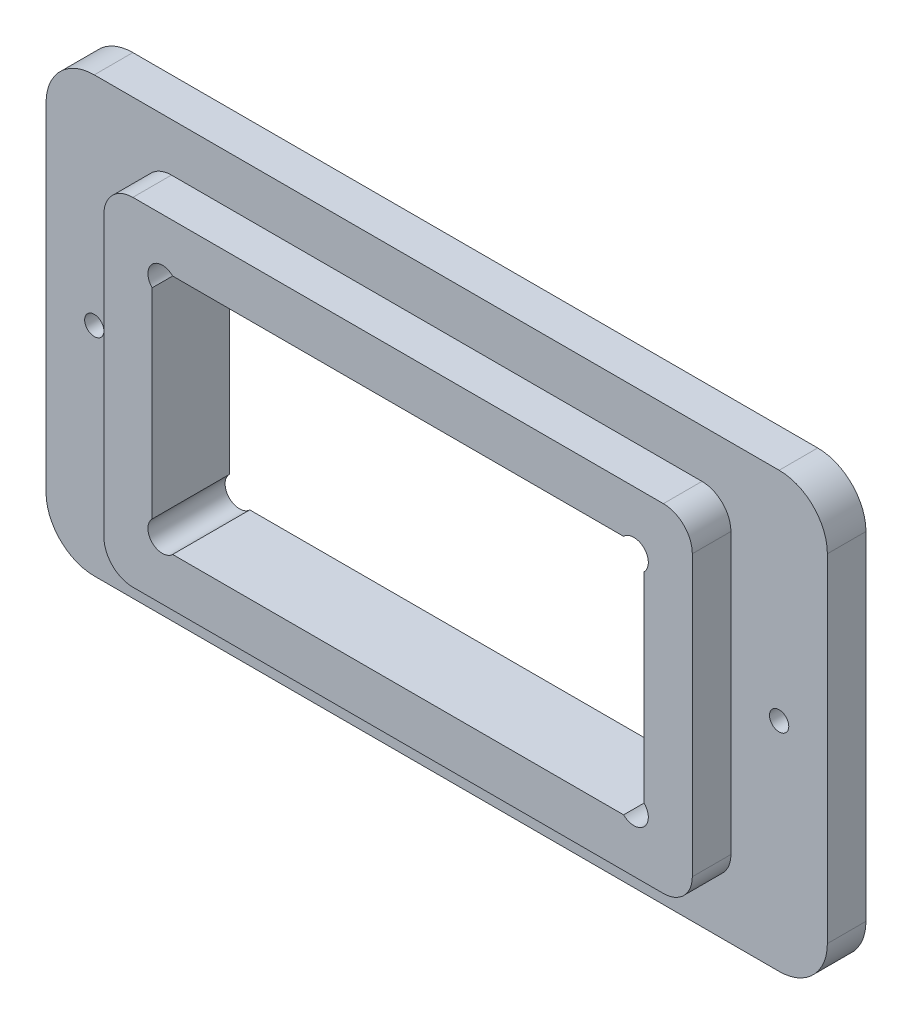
ISO-10303-21;
HEADER;
FILE_DESCRIPTION(('STEP AP214'),'2;1');
FILE_NAME('part.step','',(''),(''),'','','');
FILE_SCHEMA(('AUTOMOTIVE_DESIGN { 1 0 10303 214 1 1 1 1 }'));
ENDSEC;
DATA;
#1=APPLICATION_CONTEXT('core data for automotive mechanical design processes');
#2=APPLICATION_PROTOCOL_DEFINITION('international standard','automotive_design',2000,#1);
#3=PRODUCT_CONTEXT('',#1,'mechanical');
#4=PRODUCT('Part','Part','',(#3));
#5=PRODUCT_RELATED_PRODUCT_CATEGORY('part','',(#4));
#6=PRODUCT_DEFINITION_FORMATION('','',#4);
#7=PRODUCT_DEFINITION_CONTEXT('part definition',#1,'design');
#8=PRODUCT_DEFINITION('design','',#6,#7);
#9=PRODUCT_DEFINITION_SHAPE('','',#8);
#10=(LENGTH_UNIT() NAMED_UNIT(*) SI_UNIT(.MILLI.,.METRE.));
#11=(NAMED_UNIT(*) PLANE_ANGLE_UNIT() SI_UNIT($,.RADIAN.));
#12=(NAMED_UNIT(*) SI_UNIT($,.STERADIAN.) SOLID_ANGLE_UNIT());
#13=UNCERTAINTY_MEASURE_WITH_UNIT(LENGTH_MEASURE(1.E-05),#10,'distance_accuracy_value','');
#14=(GEOMETRIC_REPRESENTATION_CONTEXT(3) GLOBAL_UNCERTAINTY_ASSIGNED_CONTEXT((#13)) GLOBAL_UNIT_ASSIGNED_CONTEXT((#10,
#11,#12)) REPRESENTATION_CONTEXT('',''));
#15=CARTESIAN_POINT('',(0.,0.,0.));
#16=DIRECTION('',(0.,0.,1.));
#17=DIRECTION('',(1.,0.,0.));
#18=AXIS2_PLACEMENT_3D('',#15,#16,#17);
#19=CARTESIAN_POINT('',(-54.2516665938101,-16.1684939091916,8.));
#20=DIRECTION('',(0.,0.,1.));
#21=DIRECTION('',(1.,0.,0.));
#22=AXIS2_PLACEMENT_3D('',#19,#20,#21);
#23=PLANE('',#22);
#24=DIRECTION('',(0.,-1.,0.));
#25=VECTOR('',#24,1.);
#26=CARTESIAN_POINT('',(-44.2516665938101,11.7101857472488,8.));
#27=LINE('',#26,#25);
#28=CARTESIAN_POINT('',(-44.2516665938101,11.7101857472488,8.));
#29=VERTEX_POINT('',#28);
#30=CARTESIAN_POINT('',(-44.2516665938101,-9.04717356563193,8.));
#31=VERTEX_POINT('',#30);
#32=EDGE_CURVE('E309',#29,#31,#27,.T.);
#33=ORIENTED_EDGE('',*,*,#32,.F.);
#34=CARTESIAN_POINT('',(-43.1910064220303,12.7708459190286,8.));
#35=DIRECTION('',(0.,0.,1.));
#36=DIRECTION('',(1.,0.,0.));
#37=AXIS2_PLACEMENT_3D('',#34,#35,#36);
#38=CIRCLE('',#37,1.5);
#39=CARTESIAN_POINT('',(-42.1303462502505,13.8315060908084,8.));
#40=VERTEX_POINT('',#39);
#41=EDGE_CURVE('E307',#40,#29,#38,.T.);
#42=ORIENTED_EDGE('',*,*,#41,.F.);
#43=DIRECTION('',(-1.,0.,0.));
#44=VECTOR('',#43,1.);
#45=CARTESIAN_POINT('',(-42.1303462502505,13.8315060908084,8.));
#46=LINE('',#45,#44);
#47=CARTESIAN_POINT('',(4.62701306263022,13.8315060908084,8.));
#48=VERTEX_POINT('',#47);
#49=EDGE_CURVE('E323',#48,#40,#46,.T.);
#50=ORIENTED_EDGE('',*,*,#49,.F.);
#51=CARTESIAN_POINT('',(5.68767323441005,12.7708459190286,8.));
#52=DIRECTION('',(0.,0.,1.));
#53=DIRECTION('',(1.,0.,0.));
#54=AXIS2_PLACEMENT_3D('',#51,#52,#53);
#55=CIRCLE('',#54,1.50000000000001);
#56=CARTESIAN_POINT('',(6.74833340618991,11.7101857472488,8.));
#57=VERTEX_POINT('',#56);
#58=EDGE_CURVE('E320',#57,#48,#55,.T.);
#59=ORIENTED_EDGE('',*,*,#58,.F.);
#60=DIRECTION('',(0.,1.,0.));
#61=VECTOR('',#60,1.);
#62=CARTESIAN_POINT('',(6.74833340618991,11.7101857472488,8.));
#63=LINE('',#62,#61);
#64=CARTESIAN_POINT('',(6.74833340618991,-9.04717356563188,8.));
#65=VERTEX_POINT('',#64);
#66=EDGE_CURVE('E318',#65,#57,#63,.T.);
#67=ORIENTED_EDGE('',*,*,#66,.F.);
#68=CARTESIAN_POINT('',(5.68767323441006,-10.1078337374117,8.));
#69=DIRECTION('',(0.,0.,1.));
#70=DIRECTION('',(1.,0.,0.));
#71=AXIS2_PLACEMENT_3D('',#68,#69,#70);
#72=CIRCLE('',#71,1.50000000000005);
#73=CARTESIAN_POINT('',(4.62701306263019,-11.1684939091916,8.));
#74=VERTEX_POINT('',#73);
#75=EDGE_CURVE('E316',#74,#65,#72,.T.);
#76=ORIENTED_EDGE('',*,*,#75,.F.);
#77=DIRECTION('',(1.,0.,0.));
#78=VECTOR('',#77,1.);
#79=CARTESIAN_POINT('',(-42.1303462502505,-11.1684939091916,8.));
#80=LINE('',#79,#78);
#81=CARTESIAN_POINT('',(-42.1303462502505,-11.1684939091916,8.));
#82=VERTEX_POINT('',#81);
#83=EDGE_CURVE('E314',#82,#74,#80,.T.);
#84=ORIENTED_EDGE('',*,*,#83,.F.);
#85=CARTESIAN_POINT('',(-43.1910064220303,-10.1078337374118,8.));
#86=DIRECTION('',(0.,0.,1.));
#87=DIRECTION('',(1.,0.,0.));
#88=AXIS2_PLACEMENT_3D('',#85,#86,#87);
#89=CIRCLE('',#88,1.49999999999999);
#90=EDGE_CURVE('E312',#31,#82,#89,.T.);
#91=ORIENTED_EDGE('',*,*,#90,.F.);
#92=EDGE_LOOP('',(#33,#42,#50,#59,#67,#76,#84,#91));
#93=FACE_BOUND('',#92,.T.);
#94=DIRECTION('',(-1.,0.,0.));
#95=VECTOR('',#94,1.);
#96=CARTESIAN_POINT('',(-49.2516665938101,18.8315060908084,8.));
#97=LINE('',#96,#95);
#98=CARTESIAN_POINT('',(8.74833340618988,18.8315060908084,8.));
#99=VERTEX_POINT('',#98);
#100=CARTESIAN_POINT('',(-46.2516665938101,18.8315060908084,8.));
#101=VERTEX_POINT('',#100);
#102=EDGE_CURVE('E289',#99,#101,#97,.T.);
#103=ORIENTED_EDGE('',*,*,#102,.T.);
#104=CARTESIAN_POINT('',(-46.2516665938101,15.8315060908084,8.));
#105=DIRECTION('',(0.,0.,1.));
#106=DIRECTION('',(1.,0.,0.));
#107=AXIS2_PLACEMENT_3D('',#104,#105,#106);
#108=CIRCLE('',#107,3.);
#109=CARTESIAN_POINT('',(-49.2516665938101,15.8315060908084,8.));
#110=VERTEX_POINT('',#109);
#111=EDGE_CURVE('E247',#101,#110,#108,.T.);
#112=ORIENTED_EDGE('',*,*,#111,.T.);
#113=DIRECTION('',(0.,-1.,0.));
#114=VECTOR('',#113,1.);
#115=CARTESIAN_POINT('',(-49.2516665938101,18.8315060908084,8.));
#116=LINE('',#115,#114);
#117=CARTESIAN_POINT('',(-49.2516665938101,-13.1684939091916,8.));
#118=VERTEX_POINT('',#117);
#119=EDGE_CURVE('E292',#110,#118,#116,.T.);
#120=ORIENTED_EDGE('',*,*,#119,.T.);
#121=CARTESIAN_POINT('',(-46.2516665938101,-13.1684939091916,8.));
#122=DIRECTION('',(0.,0.,1.));
#123=DIRECTION('',(1.,0.,0.));
#124=AXIS2_PLACEMENT_3D('',#121,#122,#123);
#125=CIRCLE('',#124,3.);
#126=CARTESIAN_POINT('',(-46.2516665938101,-16.1684939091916,8.));
#127=VERTEX_POINT('',#126);
#128=EDGE_CURVE('E245',#118,#127,#125,.T.);
#129=ORIENTED_EDGE('',*,*,#128,.T.);
#130=DIRECTION('',(1.,0.,0.));
#131=VECTOR('',#130,1.);
#132=CARTESIAN_POINT('',(-49.2516665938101,-16.1684939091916,8.));
#133=LINE('',#132,#131);
#134=CARTESIAN_POINT('',(8.74833340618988,-16.1684939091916,8.));
#135=VERTEX_POINT('',#134);
#136=EDGE_CURVE('E286',#127,#135,#133,.T.);
#137=ORIENTED_EDGE('',*,*,#136,.T.);
#138=CARTESIAN_POINT('',(8.74833340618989,-13.1684939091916,8.));
#139=DIRECTION('',(0.,0.,1.));
#140=DIRECTION('',(1.,0.,0.));
#141=AXIS2_PLACEMENT_3D('',#138,#139,#140);
#142=CIRCLE('',#141,3.);
#143=CARTESIAN_POINT('',(11.7483334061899,-13.1684939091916,8.));
#144=VERTEX_POINT('',#143);
#145=EDGE_CURVE('E243',#135,#144,#142,.T.);
#146=ORIENTED_EDGE('',*,*,#145,.T.);
#147=DIRECTION('',(0.,1.,0.));
#148=VECTOR('',#147,1.);
#149=CARTESIAN_POINT('',(11.7483334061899,18.8315060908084,8.));
#150=LINE('',#149,#148);
#151=CARTESIAN_POINT('',(11.7483334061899,15.8315060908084,8.));
#152=VERTEX_POINT('',#151);
#153=EDGE_CURVE('E285',#144,#152,#150,.T.);
#154=ORIENTED_EDGE('',*,*,#153,.T.);
#155=CARTESIAN_POINT('',(8.74833340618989,15.8315060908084,8.));
#156=DIRECTION('',(0.,0.,1.));
#157=DIRECTION('',(1.,0.,0.));
#158=AXIS2_PLACEMENT_3D('',#155,#156,#157);
#159=CIRCLE('',#158,3.);
#160=EDGE_CURVE('E241',#152,#99,#159,.T.);
#161=ORIENTED_EDGE('',*,*,#160,.T.);
#162=EDGE_LOOP('',(#103,#112,#120,#129,#137,#146,#154,#161));
#163=FACE_BOUND('',#162,.T.);
#164=ADVANCED_FACE('F33',(#93,#163),#23,.T.);
#165=CARTESIAN_POINT('',(-54.2516665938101,-16.1684939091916,8.));
#166=DIRECTION('',(0.,0.,-1.));
#167=DIRECTION('',(-1.,0.,0.));
#168=AXIS2_PLACEMENT_3D('',#165,#166,#167);
#169=CYLINDRICAL_SURFACE('',#168,5.);
#170=CARTESIAN_POINT('',(-54.2516665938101,-16.1684939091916,4.));
#171=DIRECTION('',(0.,0.,1.));
#172=DIRECTION('',(1.,0.,0.));
#173=AXIS2_PLACEMENT_3D('',#170,#171,#172);
#174=CIRCLE('',#173,5.);
#175=CARTESIAN_POINT('',(-59.2516665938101,-16.1684939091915,4.));
#176=VERTEX_POINT('',#175);
#177=CARTESIAN_POINT('',(-54.2516665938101,-21.1684939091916,4.));
#178=VERTEX_POINT('',#177);
#179=EDGE_CURVE('E196',#176,#178,#174,.T.);
#180=ORIENTED_EDGE('',*,*,#179,.F.);
#181=DIRECTION('',(0.,0.,-1.));
#182=VECTOR('',#181,1.);
#183=CARTESIAN_POINT('',(-59.2516665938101,-16.1684939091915,8.));
#184=LINE('',#183,#182);
#185=CARTESIAN_POINT('',(-59.2516665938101,-16.1684939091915,0.));
#186=VERTEX_POINT('',#185);
#187=EDGE_CURVE('E210',#176,#186,#184,.T.);
#188=ORIENTED_EDGE('',*,*,#187,.T.);
#189=CARTESIAN_POINT('',(-54.2516665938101,-16.1684939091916,0.));
#190=DIRECTION('',(0.,0.,1.));
#191=DIRECTION('',(1.,0.,0.));
#192=AXIS2_PLACEMENT_3D('',#189,#190,#191);
#193=CIRCLE('',#192,5.);
#194=CARTESIAN_POINT('',(-54.2516665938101,-21.1684939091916,0.));
#195=VERTEX_POINT('',#194);
#196=EDGE_CURVE('E365',#186,#195,#193,.T.);
#197=ORIENTED_EDGE('',*,*,#196,.T.);
#198=DIRECTION('',(0.,0.,-1.));
#199=VECTOR('',#198,1.);
#200=CARTESIAN_POINT('',(-54.2516665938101,-21.1684939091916,8.));
#201=LINE('',#200,#199);
#202=EDGE_CURVE('E204',#178,#195,#201,.T.);
#203=ORIENTED_EDGE('',*,*,#202,.F.);
#204=EDGE_LOOP('',(#180,#188,#197,#203));
#205=FACE_BOUND('',#204,.T.);
#206=ADVANCED_FACE('F208',(#205),#169,.T.);
#207=CARTESIAN_POINT('',(-54.2516665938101,-21.1684939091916,8.));
#208=DIRECTION('',(0.,1.,0.));
#209=DIRECTION('',(0.,0.,1.));
#210=AXIS2_PLACEMENT_3D('',#207,#208,#209);
#211=PLANE('',#210);
#212=DIRECTION('',(1.,0.,0.));
#213=VECTOR('',#212,1.);
#214=CARTESIAN_POINT('',(-54.2516665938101,-21.1684939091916,4.));
#215=LINE('',#214,#213);
#216=CARTESIAN_POINT('',(16.7483334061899,-21.1684939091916,4.));
#217=VERTEX_POINT('',#216);
#218=EDGE_CURVE('E213',#178,#217,#215,.T.);
#219=ORIENTED_EDGE('',*,*,#218,.F.);
#220=ORIENTED_EDGE('',*,*,#202,.T.);
#221=DIRECTION('',(1.,0.,0.));
#222=VECTOR('',#221,1.);
#223=CARTESIAN_POINT('',(-54.2516665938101,-21.1684939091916,0.));
#224=LINE('',#223,#222);
#225=CARTESIAN_POINT('',(16.7483334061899,-21.1684939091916,0.));
#226=VERTEX_POINT('',#225);
#227=EDGE_CURVE('E367',#195,#226,#224,.T.);
#228=ORIENTED_EDGE('',*,*,#227,.T.);
#229=DIRECTION('',(0.,0.,-1.));
#230=VECTOR('',#229,1.);
#231=CARTESIAN_POINT('',(16.7483334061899,-21.1684939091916,8.));
#232=LINE('',#231,#230);
#233=EDGE_CURVE('E234',#217,#226,#232,.T.);
#234=ORIENTED_EDGE('',*,*,#233,.F.);
#235=EDGE_LOOP('',(#219,#220,#228,#234));
#236=FACE_BOUND('',#235,.T.);
#237=ADVANCED_FACE('F395',(#236),#211,.F.);
#238=CARTESIAN_POINT('',(16.7483334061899,-16.1684939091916,8.));
#239=DIRECTION('',(0.,0.,-1.));
#240=DIRECTION('',(-1.,0.,0.));
#241=AXIS2_PLACEMENT_3D('',#238,#239,#240);
#242=CYLINDRICAL_SURFACE('',#241,5.);
#243=CARTESIAN_POINT('',(16.7483334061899,-16.1684939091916,4.));
#244=DIRECTION('',(0.,0.,1.));
#245=DIRECTION('',(1.,0.,0.));
#246=AXIS2_PLACEMENT_3D('',#243,#244,#245);
#247=CIRCLE('',#246,5.);
#248=CARTESIAN_POINT('',(21.7483334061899,-16.1684939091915,4.));
#249=VERTEX_POINT('',#248);
#250=EDGE_CURVE('E304',#217,#249,#247,.T.);
#251=ORIENTED_EDGE('',*,*,#250,.F.);
#252=ORIENTED_EDGE('',*,*,#233,.T.);
#253=CARTESIAN_POINT('',(16.7483334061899,-16.1684939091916,0.));
#254=DIRECTION('',(0.,0.,1.));
#255=DIRECTION('',(1.,0.,0.));
#256=AXIS2_PLACEMENT_3D('',#253,#254,#255);
#257=CIRCLE('',#256,5.);
#258=CARTESIAN_POINT('',(21.7483334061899,-16.1684939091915,0.));
#259=VERTEX_POINT('',#258);
#260=EDGE_CURVE('E370',#226,#259,#257,.T.);
#261=ORIENTED_EDGE('',*,*,#260,.T.);
#262=DIRECTION('',(0.,0.,-1.));
#263=VECTOR('',#262,1.);
#264=CARTESIAN_POINT('',(21.7483334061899,-16.1684939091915,8.));
#265=LINE('',#264,#263);
#266=EDGE_CURVE('E232',#249,#259,#265,.T.);
#267=ORIENTED_EDGE('',*,*,#266,.F.);
#268=EDGE_LOOP('',(#251,#252,#261,#267));
#269=FACE_BOUND('',#268,.T.);
#270=ADVANCED_FACE('F400',(#269),#242,.T.);
#271=CARTESIAN_POINT('',(21.7483334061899,18.8315060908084,8.));
#272=DIRECTION('',(-1.,0.,0.));
#273=DIRECTION('',(0.,-1.,0.));
#274=AXIS2_PLACEMENT_3D('',#271,#272,#273);
#275=PLANE('',#274);
#276=DIRECTION('',(0.,1.,0.));
#277=VECTOR('',#276,1.);
#278=CARTESIAN_POINT('',(21.7483334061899,18.8315060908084,4.));
#279=LINE('',#278,#277);
#280=CARTESIAN_POINT('',(21.7483334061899,18.8315060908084,4.));
#281=VERTEX_POINT('',#280);
#282=EDGE_CURVE('E302',#249,#281,#279,.T.);
#283=ORIENTED_EDGE('',*,*,#282,.F.);
#284=ORIENTED_EDGE('',*,*,#266,.T.);
#285=DIRECTION('',(0.,1.,0.));
#286=VECTOR('',#285,1.);
#287=CARTESIAN_POINT('',(21.7483334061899,18.8315060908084,0.));
#288=LINE('',#287,#286);
#289=CARTESIAN_POINT('',(21.7483334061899,18.8315060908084,0.));
#290=VERTEX_POINT('',#289);
#291=EDGE_CURVE('E373',#259,#290,#288,.T.);
#292=ORIENTED_EDGE('',*,*,#291,.T.);
#293=DIRECTION('',(0.,0.,-1.));
#294=VECTOR('',#293,1.);
#295=CARTESIAN_POINT('',(21.7483334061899,18.8315060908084,8.));
#296=LINE('',#295,#294);
#297=EDGE_CURVE('E230',#281,#290,#296,.T.);
#298=ORIENTED_EDGE('',*,*,#297,.F.);
#299=EDGE_LOOP('',(#283,#284,#292,#298));
#300=FACE_BOUND('',#299,.T.);
#301=ADVANCED_FACE('F402',(#300),#275,.F.);
#302=CARTESIAN_POINT('',(16.7483334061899,18.8315060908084,8.));
#303=DIRECTION('',(0.,0.,-1.));
#304=DIRECTION('',(-1.,0.,0.));
#305=AXIS2_PLACEMENT_3D('',#302,#303,#304);
#306=CYLINDRICAL_SURFACE('',#305,5.);
#307=CARTESIAN_POINT('',(16.7483334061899,18.8315060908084,4.));
#308=DIRECTION('',(0.,0.,1.));
#309=DIRECTION('',(1.,0.,0.));
#310=AXIS2_PLACEMENT_3D('',#307,#308,#309);
#311=CIRCLE('',#310,5.);
#312=CARTESIAN_POINT('',(16.7483334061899,23.8315060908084,4.));
#313=VERTEX_POINT('',#312);
#314=EDGE_CURVE('E300',#281,#313,#311,.T.);
#315=ORIENTED_EDGE('',*,*,#314,.F.);
#316=ORIENTED_EDGE('',*,*,#297,.T.);
#317=CARTESIAN_POINT('',(16.7483334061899,18.8315060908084,0.));
#318=DIRECTION('',(0.,0.,1.));
#319=DIRECTION('',(-1.,0.,0.));
#320=AXIS2_PLACEMENT_3D('',#317,#318,#319);
#321=CIRCLE('',#320,5.);
#322=CARTESIAN_POINT('',(16.7483334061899,23.8315060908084,0.));
#323=VERTEX_POINT('',#322);
#324=EDGE_CURVE('E376',#290,#323,#321,.T.);
#325=ORIENTED_EDGE('',*,*,#324,.T.);
#326=DIRECTION('',(0.,0.,-1.));
#327=VECTOR('',#326,1.);
#328=CARTESIAN_POINT('',(16.7483334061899,23.8315060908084,8.));
#329=LINE('',#328,#327);
#330=EDGE_CURVE('E228',#313,#323,#329,.T.);
#331=ORIENTED_EDGE('',*,*,#330,.F.);
#332=EDGE_LOOP('',(#315,#316,#325,#331));
#333=FACE_BOUND('',#332,.T.);
#334=ADVANCED_FACE('F409',(#333),#306,.T.);
#335=CARTESIAN_POINT('',(-54.2516665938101,23.8315060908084,8.));
#336=DIRECTION('',(0.,-1.,0.));
#337=DIRECTION('',(0.,0.,-1.));
#338=AXIS2_PLACEMENT_3D('',#335,#336,#337);
#339=PLANE('',#338);
#340=DIRECTION('',(-1.,0.,0.));
#341=VECTOR('',#340,1.);
#342=CARTESIAN_POINT('',(-54.2516665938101,23.8315060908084,4.));
#343=LINE('',#342,#341);
#344=CARTESIAN_POINT('',(-54.2516665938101,23.8315060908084,4.));
#345=VERTEX_POINT('',#344);
#346=EDGE_CURVE('E297',#313,#345,#343,.T.);
#347=ORIENTED_EDGE('',*,*,#346,.F.);
#348=ORIENTED_EDGE('',*,*,#330,.T.);
#349=DIRECTION('',(-1.,0.,0.));
#350=VECTOR('',#349,1.);
#351=CARTESIAN_POINT('',(-54.2516665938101,23.8315060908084,0.));
#352=LINE('',#351,#350);
#353=CARTESIAN_POINT('',(-54.2516665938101,23.8315060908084,0.));
#354=VERTEX_POINT('',#353);
#355=EDGE_CURVE('E379',#323,#354,#352,.T.);
#356=ORIENTED_EDGE('',*,*,#355,.T.);
#357=DIRECTION('',(0.,0.,-1.));
#358=VECTOR('',#357,1.);
#359=CARTESIAN_POINT('',(-54.2516665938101,23.8315060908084,8.));
#360=LINE('',#359,#358);
#361=EDGE_CURVE('E221',#345,#354,#360,.T.);
#362=ORIENTED_EDGE('',*,*,#361,.F.);
#363=EDGE_LOOP('',(#347,#348,#356,#362));
#364=FACE_BOUND('',#363,.T.);
#365=ADVANCED_FACE('F411',(#364),#339,.F.);
#366=CARTESIAN_POINT('',(-54.2516665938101,18.8315060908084,8.));
#367=DIRECTION('',(0.,0.,-1.));
#368=DIRECTION('',(-1.,0.,0.));
#369=AXIS2_PLACEMENT_3D('',#366,#367,#368);
#370=CYLINDRICAL_SURFACE('',#369,5.);
#371=CARTESIAN_POINT('',(-54.2516665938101,18.8315060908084,4.));
#372=DIRECTION('',(0.,0.,1.));
#373=DIRECTION('',(1.,0.,0.));
#374=AXIS2_PLACEMENT_3D('',#371,#372,#373);
#375=CIRCLE('',#374,5.);
#376=CARTESIAN_POINT('',(-59.2516665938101,18.8315060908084,4.));
#377=VERTEX_POINT('',#376);
#378=EDGE_CURVE('E199',#345,#377,#375,.T.);
#379=ORIENTED_EDGE('',*,*,#378,.F.);
#380=ORIENTED_EDGE('',*,*,#361,.T.);
#381=CARTESIAN_POINT('',(-54.2516665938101,18.8315060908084,0.));
#382=DIRECTION('',(0.,0.,1.));
#383=DIRECTION('',(1.,0.,0.));
#384=AXIS2_PLACEMENT_3D('',#381,#382,#383);
#385=CIRCLE('',#384,5.);
#386=CARTESIAN_POINT('',(-59.2516665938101,18.8315060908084,0.));
#387=VERTEX_POINT('',#386);
#388=EDGE_CURVE('E223',#354,#387,#385,.T.);
#389=ORIENTED_EDGE('',*,*,#388,.T.);
#390=DIRECTION('',(0.,0.,-1.));
#391=VECTOR('',#390,1.);
#392=CARTESIAN_POINT('',(-59.2516665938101,18.8315060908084,8.));
#393=LINE('',#392,#391);
#394=EDGE_CURVE('E219',#377,#387,#393,.T.);
#395=ORIENTED_EDGE('',*,*,#394,.F.);
#396=EDGE_LOOP('',(#379,#380,#389,#395));
#397=FACE_BOUND('',#396,.T.);
#398=ADVANCED_FACE('F384',(#397),#370,.T.);
#399=CARTESIAN_POINT('',(-59.2516665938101,18.8315060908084,8.));
#400=DIRECTION('',(1.,0.,0.));
#401=DIRECTION('',(0.,1.,0.));
#402=AXIS2_PLACEMENT_3D('',#399,#400,#401);
#403=PLANE('',#402);
#404=DIRECTION('',(0.,-1.,0.));
#405=VECTOR('',#404,1.);
#406=CARTESIAN_POINT('',(-59.2516665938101,18.8315060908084,4.));
#407=LINE('',#406,#405);
#408=EDGE_CURVE('E193',#377,#176,#407,.T.);
#409=ORIENTED_EDGE('',*,*,#408,.F.);
#410=ORIENTED_EDGE('',*,*,#394,.T.);
#411=DIRECTION('',(0.,-1.,0.));
#412=VECTOR('',#411,1.);
#413=CARTESIAN_POINT('',(-59.2516665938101,18.8315060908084,0.));
#414=LINE('',#413,#412);
#415=EDGE_CURVE('E217',#387,#186,#414,.T.);
#416=ORIENTED_EDGE('',*,*,#415,.T.);
#417=ORIENTED_EDGE('',*,*,#187,.F.);
#418=EDGE_LOOP('',(#409,#410,#416,#417));
#419=FACE_BOUND('',#418,.T.);
#420=ADVANCED_FACE('F215',(#419),#403,.F.);
#421=CARTESIAN_POINT('',(-54.2516665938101,-16.1684939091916,0.));
#422=DIRECTION('',(0.,0.,1.));
#423=DIRECTION('',(1.,0.,0.));
#424=AXIS2_PLACEMENT_3D('',#421,#422,#423);
#425=PLANE('',#424);
#426=CARTESIAN_POINT('',(16.7483334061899,1.33150609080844,0.));
#427=DIRECTION('',(0.,0.,1.));
#428=DIRECTION('',(1.,0.,0.));
#429=AXIS2_PLACEMENT_3D('',#426,#427,#428);
#430=CIRCLE('',#429,1.);
#431=CARTESIAN_POINT('',(17.7483334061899,1.33150609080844,0.));
#432=VERTEX_POINT('',#431);
#433=EDGE_CURVE('E696',#432,#432,#430,.T.);
#434=ORIENTED_EDGE('',*,*,#433,.T.);
#435=EDGE_LOOP('',(#434));
#436=FACE_BOUND('',#435,.T.);
#437=CARTESIAN_POINT('',(-54.2516665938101,1.33150609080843,0.));
#438=DIRECTION('',(0.,0.,1.));
#439=DIRECTION('',(1.,0.,0.));
#440=AXIS2_PLACEMENT_3D('',#437,#438,#439);
#441=CIRCLE('',#440,0.999999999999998);
#442=CARTESIAN_POINT('',(-53.2516665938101,1.33150609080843,0.));
#443=VERTEX_POINT('',#442);
#444=EDGE_CURVE('E686',#443,#443,#441,.T.);
#445=ORIENTED_EDGE('',*,*,#444,.T.);
#446=EDGE_LOOP('',(#445));
#447=FACE_BOUND('',#446,.T.);
#448=ORIENTED_EDGE('',*,*,#196,.F.);
#449=ORIENTED_EDGE('',*,*,#415,.F.);
#450=ORIENTED_EDGE('',*,*,#388,.F.);
#451=ORIENTED_EDGE('',*,*,#355,.F.);
#452=ORIENTED_EDGE('',*,*,#324,.F.);
#453=ORIENTED_EDGE('',*,*,#291,.F.);
#454=ORIENTED_EDGE('',*,*,#260,.F.);
#455=ORIENTED_EDGE('',*,*,#227,.F.);
#456=EDGE_LOOP('',(#448,#449,#450,#451,#452,#453,#454,#455));
#457=FACE_BOUND('',#456,.T.);
#458=CARTESIAN_POINT('',(-43.1910064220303,12.7708459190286,0.));
#459=DIRECTION('',(0.,0.,1.));
#460=DIRECTION('',(1.,0.,0.));
#461=AXIS2_PLACEMENT_3D('',#458,#459,#460);
#462=CIRCLE('',#461,1.5);
#463=CARTESIAN_POINT('',(-42.1303462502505,13.8315060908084,0.));
#464=VERTEX_POINT('',#463);
#465=CARTESIAN_POINT('',(-44.2516665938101,11.7101857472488,0.));
#466=VERTEX_POINT('',#465);
#467=EDGE_CURVE('E212',#464,#466,#462,.T.);
#468=ORIENTED_EDGE('',*,*,#467,.T.);
#469=DIRECTION('',(0.,-1.,0.));
#470=VECTOR('',#469,1.);
#471=CARTESIAN_POINT('',(-44.2516665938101,11.7101857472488,0.));
#472=LINE('',#471,#470);
#473=CARTESIAN_POINT('',(-44.2516665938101,-9.04717356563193,0.));
#474=VERTEX_POINT('',#473);
#475=EDGE_CURVE('E328',#466,#474,#472,.T.);
#476=ORIENTED_EDGE('',*,*,#475,.T.);
#477=CARTESIAN_POINT('',(-43.1910064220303,-10.1078337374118,0.));
#478=DIRECTION('',(0.,0.,1.));
#479=DIRECTION('',(1.,0.,0.));
#480=AXIS2_PLACEMENT_3D('',#477,#478,#479);
#481=CIRCLE('',#480,1.49999999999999);
#482=CARTESIAN_POINT('',(-42.1303462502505,-11.1684939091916,0.));
#483=VERTEX_POINT('',#482);
#484=EDGE_CURVE('E331',#474,#483,#481,.T.);
#485=ORIENTED_EDGE('',*,*,#484,.T.);
#486=DIRECTION('',(1.,0.,0.));
#487=VECTOR('',#486,1.);
#488=CARTESIAN_POINT('',(-42.1303462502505,-11.1684939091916,0.));
#489=LINE('',#488,#487);
#490=CARTESIAN_POINT('',(4.62701306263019,-11.1684939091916,0.));
#491=VERTEX_POINT('',#490);
#492=EDGE_CURVE('E334',#483,#491,#489,.T.);
#493=ORIENTED_EDGE('',*,*,#492,.T.);
#494=CARTESIAN_POINT('',(5.68767323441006,-10.1078337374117,0.));
#495=DIRECTION('',(0.,0.,1.));
#496=DIRECTION('',(1.,0.,0.));
#497=AXIS2_PLACEMENT_3D('',#494,#495,#496);
#498=CIRCLE('',#497,1.50000000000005);
#499=CARTESIAN_POINT('',(6.74833340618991,-9.04717356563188,0.));
#500=VERTEX_POINT('',#499);
#501=EDGE_CURVE('E337',#491,#500,#498,.T.);
#502=ORIENTED_EDGE('',*,*,#501,.T.);
#503=DIRECTION('',(0.,1.,0.));
#504=VECTOR('',#503,1.);
#505=CARTESIAN_POINT('',(6.74833340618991,11.7101857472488,0.));
#506=LINE('',#505,#504);
#507=CARTESIAN_POINT('',(6.74833340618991,11.7101857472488,0.));
#508=VERTEX_POINT('',#507);
#509=EDGE_CURVE('E340',#500,#508,#506,.T.);
#510=ORIENTED_EDGE('',*,*,#509,.T.);
#511=CARTESIAN_POINT('',(5.68767323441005,12.7708459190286,0.));
#512=DIRECTION('',(0.,0.,1.));
#513=DIRECTION('',(1.,0.,0.));
#514=AXIS2_PLACEMENT_3D('',#511,#512,#513);
#515=CIRCLE('',#514,1.50000000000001);
#516=CARTESIAN_POINT('',(4.62701306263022,13.8315060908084,0.));
#517=VERTEX_POINT('',#516);
#518=EDGE_CURVE('E343',#508,#517,#515,.T.);
#519=ORIENTED_EDGE('',*,*,#518,.T.);
#520=DIRECTION('',(-1.,0.,0.));
#521=VECTOR('',#520,1.);
#522=CARTESIAN_POINT('',(-42.1303462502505,13.8315060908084,0.));
#523=LINE('',#522,#521);
#524=EDGE_CURVE('E310',#517,#464,#523,.T.);
#525=ORIENTED_EDGE('',*,*,#524,.T.);
#526=EDGE_LOOP('',(#468,#476,#485,#493,#502,#510,#519,#525));
#527=FACE_BOUND('',#526,.T.);
#528=ADVANCED_FACE('F388',(#436,#447,#457,#527),#425,.F.);
#529=CARTESIAN_POINT('',(-43.1910064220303,12.7708459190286,8.));
#530=DIRECTION('',(0.,0.,-1.));
#531=DIRECTION('',(-1.,0.,0.));
#532=AXIS2_PLACEMENT_3D('',#529,#530,#531);
#533=CYLINDRICAL_SURFACE('',#532,1.5);
#534=ORIENTED_EDGE('',*,*,#467,.F.);
#535=DIRECTION('',(0.,0.,-1.));
#536=VECTOR('',#535,1.);
#537=CARTESIAN_POINT('',(-42.1303462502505,13.8315060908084,8.));
#538=LINE('',#537,#536);
#539=EDGE_CURVE('E325',#40,#464,#538,.T.);
#540=ORIENTED_EDGE('',*,*,#539,.F.);
#541=ORIENTED_EDGE('',*,*,#41,.T.);
#542=DIRECTION('',(0.,0.,-1.));
#543=VECTOR('',#542,1.);
#544=CARTESIAN_POINT('',(-44.2516665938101,11.7101857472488,8.));
#545=LINE('',#544,#543);
#546=EDGE_CURVE('E362',#29,#466,#545,.T.);
#547=ORIENTED_EDGE('',*,*,#546,.T.);
#548=EDGE_LOOP('',(#534,#540,#541,#547));
#549=FACE_BOUND('',#548,.T.);
#550=ADVANCED_FACE('F430',(#549),#533,.F.);
#551=CARTESIAN_POINT('',(-44.2516665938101,11.7101857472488,8.));
#552=DIRECTION('',(1.,0.,0.));
#553=DIRECTION('',(0.,1.,0.));
#554=AXIS2_PLACEMENT_3D('',#551,#552,#553);
#555=PLANE('',#554);
#556=ORIENTED_EDGE('',*,*,#475,.F.);
#557=ORIENTED_EDGE('',*,*,#546,.F.);
#558=ORIENTED_EDGE('',*,*,#32,.T.);
#559=DIRECTION('',(0.,0.,-1.));
#560=VECTOR('',#559,1.);
#561=CARTESIAN_POINT('',(-44.2516665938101,-9.04717356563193,8.));
#562=LINE('',#561,#560);
#563=EDGE_CURVE('E360',#31,#474,#562,.T.);
#564=ORIENTED_EDGE('',*,*,#563,.T.);
#565=EDGE_LOOP('',(#556,#557,#558,#564));
#566=FACE_BOUND('',#565,.T.);
#567=ADVANCED_FACE('F451',(#566),#555,.T.);
#568=CARTESIAN_POINT('',(-43.1910064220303,-10.1078337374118,8.));
#569=DIRECTION('',(0.,0.,-1.));
#570=DIRECTION('',(-1.,0.,0.));
#571=AXIS2_PLACEMENT_3D('',#568,#569,#570);
#572=CYLINDRICAL_SURFACE('',#571,1.49999999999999);
#573=ORIENTED_EDGE('',*,*,#484,.F.);
#574=ORIENTED_EDGE('',*,*,#563,.F.);
#575=ORIENTED_EDGE('',*,*,#90,.T.);
#576=DIRECTION('',(0.,0.,-1.));
#577=VECTOR('',#576,1.);
#578=CARTESIAN_POINT('',(-42.1303462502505,-11.1684939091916,8.));
#579=LINE('',#578,#577);
#580=EDGE_CURVE('E358',#82,#483,#579,.T.);
#581=ORIENTED_EDGE('',*,*,#580,.T.);
#582=EDGE_LOOP('',(#573,#574,#575,#581));
#583=FACE_BOUND('',#582,.T.);
#584=ADVANCED_FACE('F458',(#583),#572,.F.);
#585=CARTESIAN_POINT('',(-42.1303462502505,-11.1684939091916,8.));
#586=DIRECTION('',(0.,1.,0.));
#587=DIRECTION('',(-1.,0.,0.));
#588=AXIS2_PLACEMENT_3D('',#585,#586,#587);
#589=PLANE('',#588);
#590=ORIENTED_EDGE('',*,*,#492,.F.);
#591=ORIENTED_EDGE('',*,*,#580,.F.);
#592=ORIENTED_EDGE('',*,*,#83,.T.);
#593=DIRECTION('',(0.,0.,-1.));
#594=VECTOR('',#593,1.);
#595=CARTESIAN_POINT('',(4.62701306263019,-11.1684939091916,8.));
#596=LINE('',#595,#594);
#597=EDGE_CURVE('E356',#74,#491,#596,.T.);
#598=ORIENTED_EDGE('',*,*,#597,.T.);
#599=EDGE_LOOP('',(#590,#591,#592,#598));
#600=FACE_BOUND('',#599,.T.);
#601=ADVANCED_FACE('F465',(#600),#589,.T.);
#602=CARTESIAN_POINT('',(5.68767323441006,-10.1078337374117,8.));
#603=DIRECTION('',(0.,0.,-1.));
#604=DIRECTION('',(-1.,0.,0.));
#605=AXIS2_PLACEMENT_3D('',#602,#603,#604);
#606=CYLINDRICAL_SURFACE('',#605,1.50000000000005);
#607=ORIENTED_EDGE('',*,*,#501,.F.);
#608=ORIENTED_EDGE('',*,*,#597,.F.);
#609=ORIENTED_EDGE('',*,*,#75,.T.);
#610=DIRECTION('',(0.,0.,-1.));
#611=VECTOR('',#610,1.);
#612=CARTESIAN_POINT('',(6.74833340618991,-9.04717356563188,8.));
#613=LINE('',#612,#611);
#614=EDGE_CURVE('E354',#65,#500,#613,.T.);
#615=ORIENTED_EDGE('',*,*,#614,.T.);
#616=EDGE_LOOP('',(#607,#608,#609,#615));
#617=FACE_BOUND('',#616,.T.);
#618=ADVANCED_FACE('F473',(#617),#606,.F.);
#619=CARTESIAN_POINT('',(6.74833340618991,11.7101857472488,8.));
#620=DIRECTION('',(-1.,0.,0.));
#621=DIRECTION('',(0.,-1.,0.));
#622=AXIS2_PLACEMENT_3D('',#619,#620,#621);
#623=PLANE('',#622);
#624=ORIENTED_EDGE('',*,*,#509,.F.);
#625=ORIENTED_EDGE('',*,*,#614,.F.);
#626=ORIENTED_EDGE('',*,*,#66,.T.);
#627=DIRECTION('',(0.,0.,-1.));
#628=VECTOR('',#627,1.);
#629=CARTESIAN_POINT('',(6.74833340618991,11.7101857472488,8.));
#630=LINE('',#629,#628);
#631=EDGE_CURVE('E352',#57,#508,#630,.T.);
#632=ORIENTED_EDGE('',*,*,#631,.T.);
#633=EDGE_LOOP('',(#624,#625,#626,#632));
#634=FACE_BOUND('',#633,.T.);
#635=ADVANCED_FACE('F481',(#634),#623,.T.);
#636=CARTESIAN_POINT('',(5.68767323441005,12.7708459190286,8.));
#637=DIRECTION('',(0.,0.,-1.));
#638=DIRECTION('',(-1.,0.,0.));
#639=AXIS2_PLACEMENT_3D('',#636,#637,#638);
#640=CYLINDRICAL_SURFACE('',#639,1.50000000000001);
#641=ORIENTED_EDGE('',*,*,#518,.F.);
#642=ORIENTED_EDGE('',*,*,#631,.F.);
#643=ORIENTED_EDGE('',*,*,#58,.T.);
#644=DIRECTION('',(0.,0.,-1.));
#645=VECTOR('',#644,1.);
#646=CARTESIAN_POINT('',(4.62701306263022,13.8315060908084,8.));
#647=LINE('',#646,#645);
#648=EDGE_CURVE('E350',#48,#517,#647,.T.);
#649=ORIENTED_EDGE('',*,*,#648,.T.);
#650=EDGE_LOOP('',(#641,#642,#643,#649));
#651=FACE_BOUND('',#650,.T.);
#652=ADVANCED_FACE('F489',(#651),#640,.F.);
#653=CARTESIAN_POINT('',(-42.1303462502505,13.8315060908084,8.));
#654=DIRECTION('',(0.,-1.,0.));
#655=DIRECTION('',(1.,0.,0.));
#656=AXIS2_PLACEMENT_3D('',#653,#654,#655);
#657=PLANE('',#656);
#658=ORIENTED_EDGE('',*,*,#524,.F.);
#659=ORIENTED_EDGE('',*,*,#648,.F.);
#660=ORIENTED_EDGE('',*,*,#49,.T.);
#661=ORIENTED_EDGE('',*,*,#539,.T.);
#662=EDGE_LOOP('',(#658,#659,#660,#661));
#663=FACE_BOUND('',#662,.T.);
#664=ADVANCED_FACE('F497',(#663),#657,.T.);
#665=CARTESIAN_POINT('',(-18.7516665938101,1.33150609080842,4.));
#666=DIRECTION('',(0.,0.,1.));
#667=DIRECTION('',(1.,0.,0.));
#668=AXIS2_PLACEMENT_3D('',#665,#666,#667);
#669=PLANE('',#668);
#670=CARTESIAN_POINT('',(16.7483334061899,1.33150609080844,4.));
#671=DIRECTION('',(0.,0.,1.));
#672=DIRECTION('',(1.,0.,0.));
#673=AXIS2_PLACEMENT_3D('',#670,#671,#672);
#674=CIRCLE('',#673,1.);
#675=CARTESIAN_POINT('',(17.7483334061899,1.33150609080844,4.));
#676=VERTEX_POINT('',#675);
#677=EDGE_CURVE('E699',#676,#676,#674,.T.);
#678=ORIENTED_EDGE('',*,*,#677,.F.);
#679=EDGE_LOOP('',(#678));
#680=FACE_BOUND('',#679,.T.);
#681=CARTESIAN_POINT('',(-54.2516665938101,1.33150609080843,4.));
#682=DIRECTION('',(0.,0.,1.));
#683=DIRECTION('',(1.,0.,0.));
#684=AXIS2_PLACEMENT_3D('',#681,#682,#683);
#685=CIRCLE('',#684,0.999999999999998);
#686=CARTESIAN_POINT('',(-53.2516665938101,1.33150609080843,4.));
#687=VERTEX_POINT('',#686);
#688=EDGE_CURVE('E688',#687,#687,#685,.T.);
#689=ORIENTED_EDGE('',*,*,#688,.F.);
#690=EDGE_LOOP('',(#689));
#691=FACE_BOUND('',#690,.T.);
#692=DIRECTION('',(-1.,0.,0.));
#693=VECTOR('',#692,1.);
#694=CARTESIAN_POINT('',(-49.2516665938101,18.8315060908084,4.));
#695=LINE('',#694,#693);
#696=CARTESIAN_POINT('',(8.74833340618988,18.8315060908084,4.));
#697=VERTEX_POINT('',#696);
#698=CARTESIAN_POINT('',(-46.2516665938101,18.8315060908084,4.));
#699=VERTEX_POINT('',#698);
#700=EDGE_CURVE('E298',#697,#699,#695,.T.);
#701=ORIENTED_EDGE('',*,*,#700,.F.);
#702=CARTESIAN_POINT('',(8.74833340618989,15.8315060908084,4.));
#703=DIRECTION('',(0.,0.,1.));
#704=DIRECTION('',(1.,0.,0.));
#705=AXIS2_PLACEMENT_3D('',#702,#703,#704);
#706=CIRCLE('',#705,3.);
#707=CARTESIAN_POINT('',(11.7483334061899,15.8315060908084,4.));
#708=VERTEX_POINT('',#707);
#709=EDGE_CURVE('E12',#697,#708,#706,.F.);
#710=ORIENTED_EDGE('',*,*,#709,.T.);
#711=DIRECTION('',(0.,1.,0.));
#712=VECTOR('',#711,1.);
#713=CARTESIAN_POINT('',(11.7483334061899,18.8315060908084,4.));
#714=LINE('',#713,#712);
#715=CARTESIAN_POINT('',(11.7483334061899,-13.1684939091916,4.));
#716=VERTEX_POINT('',#715);
#717=EDGE_CURVE('E271',#716,#708,#714,.T.);
#718=ORIENTED_EDGE('',*,*,#717,.F.);
#719=CARTESIAN_POINT('',(8.74833340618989,-13.1684939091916,4.));
#720=DIRECTION('',(0.,0.,1.));
#721=DIRECTION('',(1.,0.,0.));
#722=AXIS2_PLACEMENT_3D('',#719,#720,#721);
#723=CIRCLE('',#722,3.);
#724=CARTESIAN_POINT('',(8.74833340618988,-16.1684939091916,4.));
#725=VERTEX_POINT('',#724);
#726=EDGE_CURVE('E41',#716,#725,#723,.F.);
#727=ORIENTED_EDGE('',*,*,#726,.T.);
#728=DIRECTION('',(1.,0.,0.));
#729=VECTOR('',#728,1.);
#730=CARTESIAN_POINT('',(-49.2516665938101,-16.1684939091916,4.));
#731=LINE('',#730,#729);
#732=CARTESIAN_POINT('',(-46.2516665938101,-16.1684939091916,4.));
#733=VERTEX_POINT('',#732);
#734=EDGE_CURVE('E269',#733,#725,#731,.T.);
#735=ORIENTED_EDGE('',*,*,#734,.F.);
#736=CARTESIAN_POINT('',(-46.2516665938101,-13.1684939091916,4.));
#737=DIRECTION('',(0.,0.,1.));
#738=DIRECTION('',(1.,0.,0.));
#739=AXIS2_PLACEMENT_3D('',#736,#737,#738);
#740=CIRCLE('',#739,3.);
#741=CARTESIAN_POINT('',(-49.2516665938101,-13.1684939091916,4.));
#742=VERTEX_POINT('',#741);
#743=EDGE_CURVE('E265',#733,#742,#740,.F.);
#744=ORIENTED_EDGE('',*,*,#743,.T.);
#745=DIRECTION('',(0.,-1.,0.));
#746=VECTOR('',#745,1.);
#747=CARTESIAN_POINT('',(-49.2516665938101,18.8315060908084,4.));
#748=LINE('',#747,#746);
#749=CARTESIAN_POINT('',(-49.2516665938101,15.8315060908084,4.));
#750=VERTEX_POINT('',#749);
#751=EDGE_CURVE('E279',#750,#742,#748,.T.);
#752=ORIENTED_EDGE('',*,*,#751,.F.);
#753=CARTESIAN_POINT('',(-46.2516665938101,15.8315060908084,4.));
#754=DIRECTION('',(0.,0.,1.));
#755=DIRECTION('',(1.,0.,0.));
#756=AXIS2_PLACEMENT_3D('',#753,#754,#755);
#757=CIRCLE('',#756,3.);
#758=EDGE_CURVE('E263',#750,#699,#757,.F.);
#759=ORIENTED_EDGE('',*,*,#758,.T.);
#760=EDGE_LOOP('',(#701,#710,#718,#727,#735,#744,#752,#759));
#761=FACE_BOUND('',#760,.T.);
#762=ORIENTED_EDGE('',*,*,#179,.T.);
#763=ORIENTED_EDGE('',*,*,#218,.T.);
#764=ORIENTED_EDGE('',*,*,#250,.T.);
#765=ORIENTED_EDGE('',*,*,#282,.T.);
#766=ORIENTED_EDGE('',*,*,#314,.T.);
#767=ORIENTED_EDGE('',*,*,#346,.T.);
#768=ORIENTED_EDGE('',*,*,#378,.T.);
#769=ORIENTED_EDGE('',*,*,#408,.T.);
#770=EDGE_LOOP('',(#762,#763,#764,#765,#766,#767,#768,#769));
#771=FACE_BOUND('',#770,.T.);
#772=ADVANCED_FACE('F195',(#680,#691,#761,#771),#669,.T.);
#773=CARTESIAN_POINT('',(-49.2516665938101,18.8315060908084,4.));
#774=DIRECTION('',(-1.,0.,0.));
#775=DIRECTION('',(0.,0.,1.));
#776=AXIS2_PLACEMENT_3D('',#773,#774,#775);
#777=PLANE('',#776);
#778=ORIENTED_EDGE('',*,*,#119,.F.);
#779=DIRECTION('',(0.,0.,1.));
#780=VECTOR('',#779,1.);
#781=CARTESIAN_POINT('',(-49.2516665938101,15.8315060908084,4.));
#782=LINE('',#781,#780);
#783=EDGE_CURVE('E252',#110,#750,#782,.F.);
#784=ORIENTED_EDGE('',*,*,#783,.T.);
#785=ORIENTED_EDGE('',*,*,#751,.T.);
#786=DIRECTION('',(0.,0.,1.));
#787=VECTOR('',#786,1.);
#788=CARTESIAN_POINT('',(-49.2516665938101,-13.1684939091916,4.));
#789=LINE('',#788,#787);
#790=EDGE_CURVE('E249',#742,#118,#789,.T.);
#791=ORIENTED_EDGE('',*,*,#790,.T.);
#792=EDGE_LOOP('',(#778,#784,#785,#791));
#793=FACE_BOUND('',#792,.T.);
#794=ADVANCED_FACE('F513',(#793),#777,.T.);
#795=CARTESIAN_POINT('',(-49.2516665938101,18.8315060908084,4.));
#796=DIRECTION('',(0.,1.,0.));
#797=DIRECTION('',(0.,0.,1.));
#798=AXIS2_PLACEMENT_3D('',#795,#796,#797);
#799=PLANE('',#798);
#800=ORIENTED_EDGE('',*,*,#700,.T.);
#801=DIRECTION('',(0.,0.,1.));
#802=VECTOR('',#801,1.);
#803=CARTESIAN_POINT('',(-46.2516665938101,18.8315060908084,4.));
#804=LINE('',#803,#802);
#805=EDGE_CURVE('E238',#699,#101,#804,.T.);
#806=ORIENTED_EDGE('',*,*,#805,.T.);
#807=ORIENTED_EDGE('',*,*,#102,.F.);
#808=DIRECTION('',(0.,0.,1.));
#809=VECTOR('',#808,1.);
#810=CARTESIAN_POINT('',(8.74833340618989,18.8315060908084,4.));
#811=LINE('',#810,#809);
#812=EDGE_CURVE('E203',#99,#697,#811,.F.);
#813=ORIENTED_EDGE('',*,*,#812,.T.);
#814=EDGE_LOOP('',(#800,#806,#807,#813));
#815=FACE_BOUND('',#814,.T.);
#816=ADVANCED_FACE('F521',(#815),#799,.T.);
#817=CARTESIAN_POINT('',(11.7483334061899,18.8315060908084,4.));
#818=DIRECTION('',(1.,0.,0.));
#819=DIRECTION('',(0.,1.,0.));
#820=AXIS2_PLACEMENT_3D('',#817,#818,#819);
#821=PLANE('',#820);
#822=ORIENTED_EDGE('',*,*,#153,.F.);
#823=DIRECTION('',(0.,0.,1.));
#824=VECTOR('',#823,1.);
#825=CARTESIAN_POINT('',(11.7483334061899,-13.1684939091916,4.));
#826=LINE('',#825,#824);
#827=EDGE_CURVE('E53',#144,#716,#826,.F.);
#828=ORIENTED_EDGE('',*,*,#827,.T.);
#829=ORIENTED_EDGE('',*,*,#717,.T.);
#830=DIRECTION('',(0.,0.,1.));
#831=VECTOR('',#830,1.);
#832=CARTESIAN_POINT('',(11.7483334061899,15.8315060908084,4.));
#833=LINE('',#832,#831);
#834=EDGE_CURVE('E259',#708,#152,#833,.T.);
#835=ORIENTED_EDGE('',*,*,#834,.T.);
#836=EDGE_LOOP('',(#822,#828,#829,#835));
#837=FACE_BOUND('',#836,.T.);
#838=ADVANCED_FACE('F287',(#837),#821,.T.);
#839=CARTESIAN_POINT('',(-49.2516665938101,-16.1684939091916,4.));
#840=DIRECTION('',(0.,-1.,0.));
#841=DIRECTION('',(0.,0.,-1.));
#842=AXIS2_PLACEMENT_3D('',#839,#840,#841);
#843=PLANE('',#842);
#844=ORIENTED_EDGE('',*,*,#136,.F.);
#845=DIRECTION('',(0.,0.,1.));
#846=VECTOR('',#845,1.);
#847=CARTESIAN_POINT('',(-46.2516665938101,-16.1684939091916,4.));
#848=LINE('',#847,#846);
#849=EDGE_CURVE('E257',#127,#733,#848,.F.);
#850=ORIENTED_EDGE('',*,*,#849,.T.);
#851=ORIENTED_EDGE('',*,*,#734,.T.);
#852=DIRECTION('',(0.,0.,1.));
#853=VECTOR('',#852,1.);
#854=CARTESIAN_POINT('',(8.74833340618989,-16.1684939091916,4.));
#855=LINE('',#854,#853);
#856=EDGE_CURVE('E254',#725,#135,#855,.T.);
#857=ORIENTED_EDGE('',*,*,#856,.T.);
#858=EDGE_LOOP('',(#844,#850,#851,#857));
#859=FACE_BOUND('',#858,.T.);
#860=ADVANCED_FACE('F276',(#859),#843,.T.);
#861=CARTESIAN_POINT('',(-54.2516665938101,1.33150609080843,-6.));
#862=DIRECTION('',(0.,0.,1.));
#863=DIRECTION('',(1.,0.,0.));
#864=AXIS2_PLACEMENT_3D('',#861,#862,#863);
#865=CYLINDRICAL_SURFACE('',#864,0.999999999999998);
#866=ORIENTED_EDGE('',*,*,#688,.T.);
#867=EDGE_LOOP('',(#866));
#868=FACE_BOUND('',#867,.T.);
#869=ORIENTED_EDGE('',*,*,#444,.F.);
#870=EDGE_LOOP('',(#869));
#871=FACE_BOUND('',#870,.T.);
#872=ADVANCED_FACE('F542',(#868,#871),#865,.F.);
#873=CARTESIAN_POINT('',(16.7483334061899,1.33150609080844,-6.));
#874=DIRECTION('',(0.,0.,1.));
#875=DIRECTION('',(1.,0.,0.));
#876=AXIS2_PLACEMENT_3D('',#873,#874,#875);
#877=CYLINDRICAL_SURFACE('',#876,1.);
#878=ORIENTED_EDGE('',*,*,#677,.T.);
#879=EDGE_LOOP('',(#878));
#880=FACE_BOUND('',#879,.T.);
#881=ORIENTED_EDGE('',*,*,#433,.F.);
#882=EDGE_LOOP('',(#881));
#883=FACE_BOUND('',#882,.T.);
#884=ADVANCED_FACE('F549',(#880,#883),#877,.F.);
#885=CARTESIAN_POINT('',(-46.2516665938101,15.8315060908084,4.));
#886=DIRECTION('',(0.,0.,1.));
#887=DIRECTION('',(1.,0.,0.));
#888=AXIS2_PLACEMENT_3D('',#885,#886,#887);
#889=CYLINDRICAL_SURFACE('',#888,3.);
#890=ORIENTED_EDGE('',*,*,#758,.F.);
#891=ORIENTED_EDGE('',*,*,#783,.F.);
#892=ORIENTED_EDGE('',*,*,#111,.F.);
#893=ORIENTED_EDGE('',*,*,#805,.F.);
#894=EDGE_LOOP('',(#890,#891,#892,#893));
#895=FACE_BOUND('',#894,.T.);
#896=ADVANCED_FACE('F557',(#895),#889,.T.);
#897=CARTESIAN_POINT('',(-46.2516665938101,-13.1684939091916,4.));
#898=DIRECTION('',(0.,0.,1.));
#899=DIRECTION('',(1.,0.,0.));
#900=AXIS2_PLACEMENT_3D('',#897,#898,#899);
#901=CYLINDRICAL_SURFACE('',#900,3.);
#902=ORIENTED_EDGE('',*,*,#743,.F.);
#903=ORIENTED_EDGE('',*,*,#849,.F.);
#904=ORIENTED_EDGE('',*,*,#128,.F.);
#905=ORIENTED_EDGE('',*,*,#790,.F.);
#906=EDGE_LOOP('',(#902,#903,#904,#905));
#907=FACE_BOUND('',#906,.T.);
#908=ADVANCED_FACE('F564',(#907),#901,.T.);
#909=CARTESIAN_POINT('',(8.74833340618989,-13.1684939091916,4.));
#910=DIRECTION('',(0.,0.,1.));
#911=DIRECTION('',(1.,0.,0.));
#912=AXIS2_PLACEMENT_3D('',#909,#910,#911);
#913=CYLINDRICAL_SURFACE('',#912,3.);
#914=ORIENTED_EDGE('',*,*,#726,.F.);
#915=ORIENTED_EDGE('',*,*,#827,.F.);
#916=ORIENTED_EDGE('',*,*,#145,.F.);
#917=ORIENTED_EDGE('',*,*,#856,.F.);
#918=EDGE_LOOP('',(#914,#915,#916,#917));
#919=FACE_BOUND('',#918,.T.);
#920=ADVANCED_FACE('F281',(#919),#913,.T.);
#921=CARTESIAN_POINT('',(8.74833340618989,15.8315060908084,4.));
#922=DIRECTION('',(0.,0.,1.));
#923=DIRECTION('',(1.,0.,0.));
#924=AXIS2_PLACEMENT_3D('',#921,#922,#923);
#925=CYLINDRICAL_SURFACE('',#924,3.);
#926=ORIENTED_EDGE('',*,*,#709,.F.);
#927=ORIENTED_EDGE('',*,*,#812,.F.);
#928=ORIENTED_EDGE('',*,*,#160,.F.);
#929=ORIENTED_EDGE('',*,*,#834,.F.);
#930=EDGE_LOOP('',(#926,#927,#928,#929));
#931=FACE_BOUND('',#930,.T.);
#932=ADVANCED_FACE('F35',(#931),#925,.T.);
#933=CLOSED_SHELL('',(#164,#206,#237,#270,#301,#334,#365,#398,#420,#528,#550,#567,#584,#601,
#618,#635,#652,#664,#772,#794,#816,#838,#860,#872,#884,#896,#908,#920,#932));
#934=MANIFOLD_SOLID_BREP('B2',#933);
#935=ADVANCED_BREP_SHAPE_REPRESENTATION('',(#18,#934),#14);
#936=SHAPE_DEFINITION_REPRESENTATION(#9,#935);
ENDSEC;
END-ISO-10303-21;
